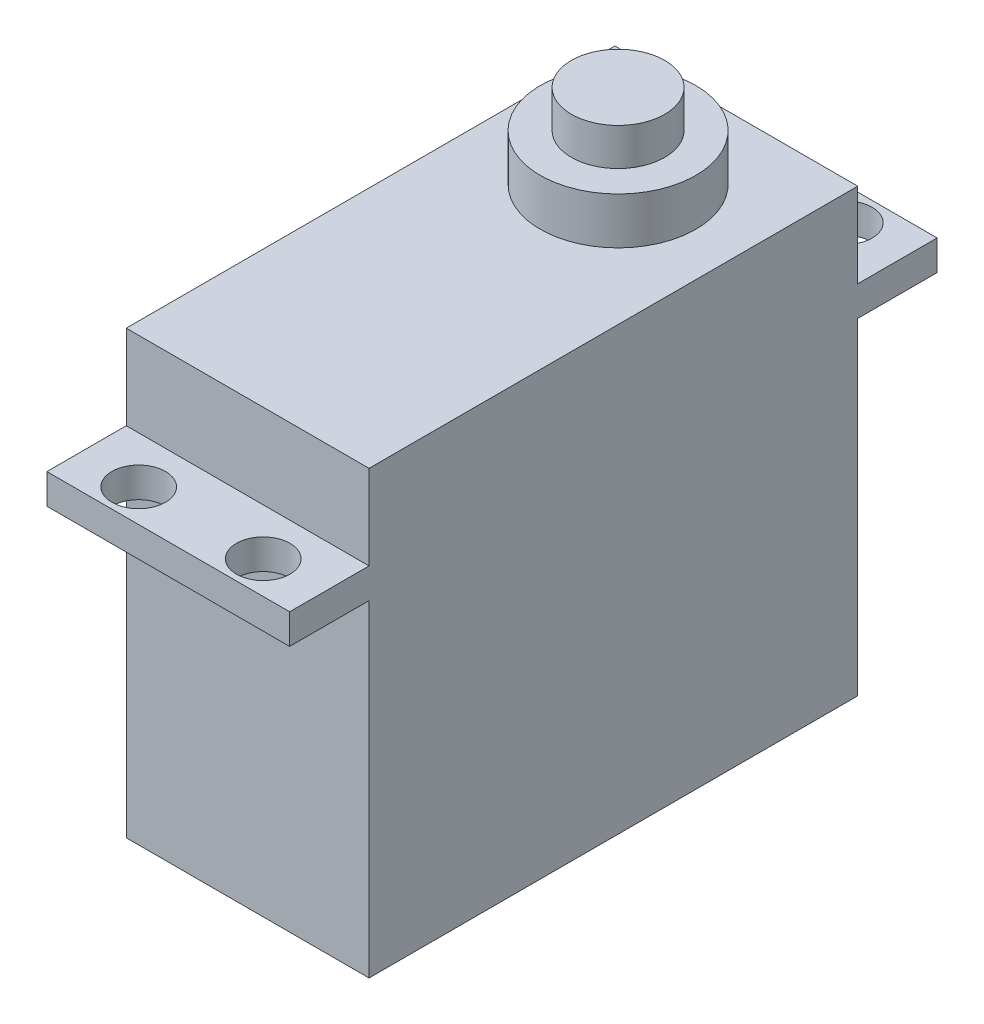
from build123d import *

# Parameters (mm, degrees)
SKETCH1_W               = 19.812
SKETCH1_H               = 39.878
EXTRUDE1_DEPTH          = 36.0172
SKETCH3_W               = 19.812
SKETCH3_H               = 2.45
EXTRUDE3_DEPTH          = 6.477
SKETCH5_R               = 2.1844
CUT_EXTRUDE1_DEPTH      = 41.545138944
MIRROR3_COPY_1_SKETCH_R = 2.1844
MIRROR3_COPY_1_DEPTH    = 41.545138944
SKETCH4_R               = 6.35
EXTRUDE4_DEPTH          = 3.81
SKETCH6_R               = 3.81
EXTRUDE5_DEPTH          = 3.048


with BuildPart() as part:
    # Sketch1 → Extrude1 (new body)
    with BuildSketch(Plane(origin=(0, 0, 0), x_dir=(1, 0, 0), z_dir=(0, 1, 0))):
        Rectangle(SKETCH1_W, SKETCH1_H)
    extrude(amount=EXTRUDE1_DEPTH)

    # Sketch3 → Extrude3 (add)
    with BuildSketch(Plane.XY.offset(19.939)):
        with Locations((0, 27.895)):
            Rectangle(SKETCH3_W, SKETCH3_H)
    extrude3 = extrude(amount=EXTRUDE3_DEPTH)

    # Mirror1: Extrude3 across plane
    add(extrude3.mirror(Plane.XY))

    # Sketch5 → Cut-Extrude1 (cut, through all)
    with BuildSketch(Plane(origin=(0, 29.12, 0), x_dir=(1, 0, 0), z_dir=(0, 1, 0))):
        with Locations(Location((5.08, -23.749, 0), (0, 0, 270))):
            Circle(SKETCH5_R)
    cut_extrude1 = extrude(amount=-CUT_EXTRUDE1_DEPTH, mode=Mode.SUBTRACT)

    # Mirror2: Cut-Extrude1 across plane
    add(cut_extrude1.mirror(Plane.XY), mode=Mode.SUBTRACT)

    # Mirror3: Cut-Extrude1 across plane
    add(cut_extrude1.mirror(Plane(origin=(0, 0, 0), x_dir=(0, 0, 1), z_dir=(1, 0, 0))), mode=Mode.SUBTRACT)

    # Mirror3 copy 1 sketch → Mirror3 copy 1 (cut, through all)
    with BuildSketch(Plane(origin=(0, 29.12, 0), x_dir=(-1, 0, 0), z_dir=(0, 1, 0))):
        with Locations(Location((5.08, -23.749, 0), (0, 0, 270))):
            Circle(MIRROR3_COPY_1_SKETCH_R)
    extrude(amount=-MIRROR3_COPY_1_DEPTH, mode=Mode.SUBTRACT)

    # Sketch4 → Extrude4 (add)
    with BuildSketch(Plane(origin=(0, 36.0172, 0), x_dir=(1, 0, 0), z_dir=(0, 1, 0))):
        with Locations(Location((0, 10.287, 0), (0, 0, 90))):
            Circle(SKETCH4_R)
    extrude(amount=EXTRUDE4_DEPTH)

    # Sketch6 → Extrude5 (add)
    with BuildSketch(Plane(origin=(0, 39.8272, 0), x_dir=(1, 0, 0), z_dir=(0, 1, 0))):
        with Locations(Location((0, 10.287, 0), (0, 0, 90))):
            Circle(SKETCH6_R)
    extrude(amount=EXTRUDE5_DEPTH)


solid = part.part
